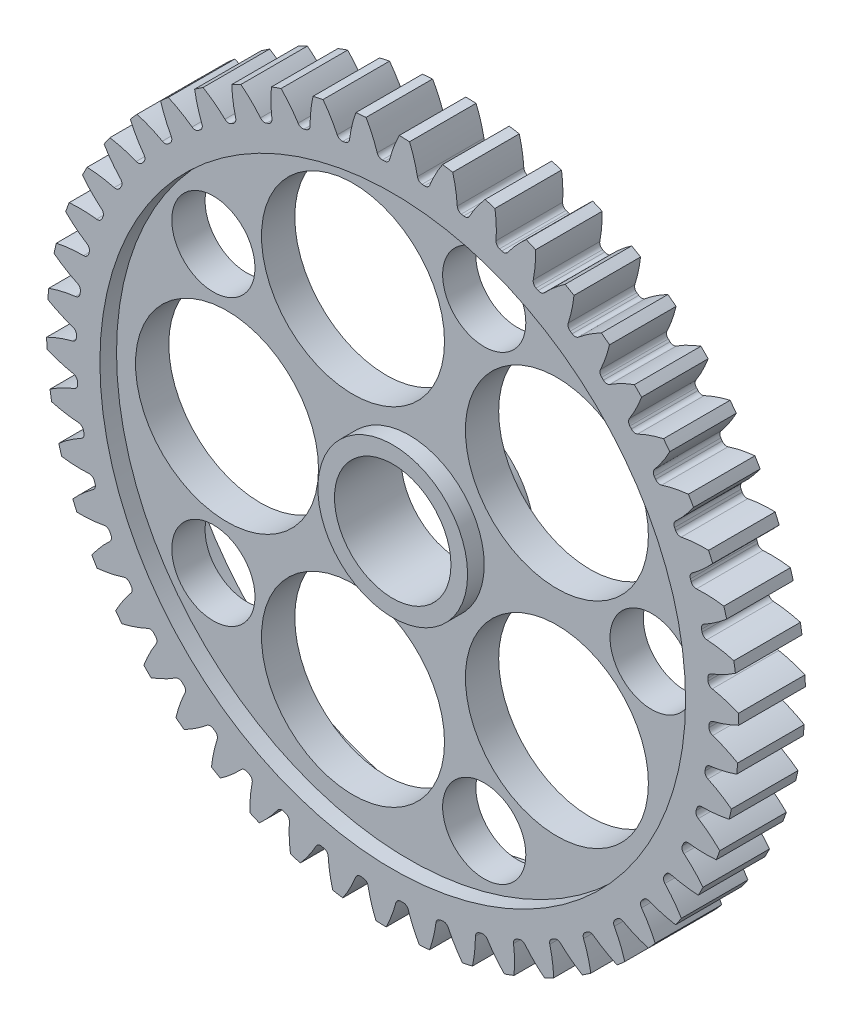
from build123d import *

# Parameters (mm, degrees)
SKETCH3_R          = 66.04
GEARBODY_DEPTH     = 12.7
TOOTHCUT_DEPTH     = 95.254194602
CIRPATTERN1_COUNT  = 50
BOREDIA_R          = 11.1125
BORE_DEPTH         = 12700
SKETCH4_R          = 55.88
SKETCH4_R_2        = 14.2875
CUT_EXTRUDE1_DEPTH = 3.175
CUT_EXTRUDE2_START = -3.175
SKETCH7_R          = 55.88
SKETCH7_R_2        = 14.2875
CUT_EXTRUDE2_DEPTH = 3.175
SKETCH8_R          = 17.4625
CUT_EXTRUDE3_DEPTH = 94.866046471
SKETCH9_R          = 7.9375
CUT_EXTRUDE4_DEPTH = 94.866046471


with BuildPart() as part:
    # Sketch3 → gearBody (new body)
    with BuildSketch(Plane.XY):
        Circle(SKETCH3_R)
    extrude(amount=GEARBODY_DEPTH)

    # Sketch2 → toothCut (cut, through all)
    with BuildSketch(Plane.XY):
        with BuildLine():
            ThreePointArc((60.358860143, -2.261186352), (60.366863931, -2.036344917), (60.37403017, -1.811475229))
            ThreePointArc((60.37403017, -1.811475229), (60.593413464, -1.216467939), (61.126952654, -0.873687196))
            ThreePointArc((61.126952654, -0.873687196), (69.13846794, 2.7900315), (75.332022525, 9.054781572))
            ThreePointArc((75.332022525, 9.054781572), (75.831123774, -2.557998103), (74.550583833, -14.110745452))
            ThreePointArc((74.550583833, -14.110745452), (68.793283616, -7.442859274), (61.046874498, -3.247581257))
            ThreePointArc((61.046874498, -3.247581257), (60.537647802, -2.869625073), (60.358860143, -2.261186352))
        make_face()
    toothcut = extrude(amount=TOOTHCUT_DEPTH, mode=Mode.SUBTRACT)

    # CirPattern1: toothCut ×50 about axis
    cirpattern1_axis = Axis((0, 0, 0), (0, 0, 1))
    for i in range(1, CIRPATTERN1_COUNT):
        add(toothcut.rotate(cirpattern1_axis, i * 360 / CIRPATTERN1_COUNT), mode=Mode.SUBTRACT)

    # boreDia → bore (cut, symmetric)
    with BuildSketch(Plane.XY):
        Circle(BOREDIA_R)
    extrude(amount=BORE_DEPTH, both=True, mode=Mode.SUBTRACT)

    # Sketch4 → Cut-Extrude1 (cut)
    with BuildSketch(Plane.XY.offset(12.7)):
        Circle(SKETCH4_R)
        Circle(SKETCH4_R_2, mode=Mode.SUBTRACT)
    extrude(amount=-CUT_EXTRUDE1_DEPTH, mode=Mode.SUBTRACT)

    # Sketch7 → Cut-Extrude2 (cut)
    with BuildSketch(Plane(origin=(0, 0, 0), x_dir=(-1, 0, 0), z_dir=(0, 0, -1)).offset(CUT_EXTRUDE2_START)):
        with Locations(Location((0, 0, 0), (0, 0, 180))):
            Circle(SKETCH7_R)
        with Locations(Location((0, 0, 0), (0, 0, 180))):
            Circle(SKETCH7_R_2, mode=Mode.SUBTRACT)
    extrude(amount=CUT_EXTRUDE2_DEPTH, mode=Mode.SUBTRACT)

    # Sketch8 → Cut-Extrude3 (cut, through all)
    with BuildSketch(Plane.XY.offset(9.525)):
        with Locations((-34.798, 0)):
            Circle(SKETCH8_R)
        with Locations((-10.75317337, 33.094864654)):
            Circle(SKETCH8_R)
        with Locations((28.15217337, 20.453751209)):
            Circle(SKETCH8_R)
        with Locations((28.15217337, -20.453751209)):
            Circle(SKETCH8_R)
        with Locations((-10.75317337, -33.094864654)):
            Circle(SKETCH8_R)
    extrude(amount=-CUT_EXTRUDE3_DEPTH, mode=Mode.SUBTRACT)

    # Sketch9 → Cut-Extrude4 (cut, through all)
    with BuildSketch(Plane.XY.offset(9.525)):
        with Locations((46.228, 0)):
            Circle(SKETCH9_R)
        with Locations((14.285237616, -43.965440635)):
            Circle(SKETCH9_R)
        with Locations((-37.399237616, -27.172136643)):
            Circle(SKETCH9_R)
        with Locations((-37.399237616, 27.172136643)):
            Circle(SKETCH9_R)
        with Locations((14.285237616, 43.965440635)):
            Circle(SKETCH9_R)
    extrude(amount=-CUT_EXTRUDE4_DEPTH, mode=Mode.SUBTRACT)


solid = part.part
